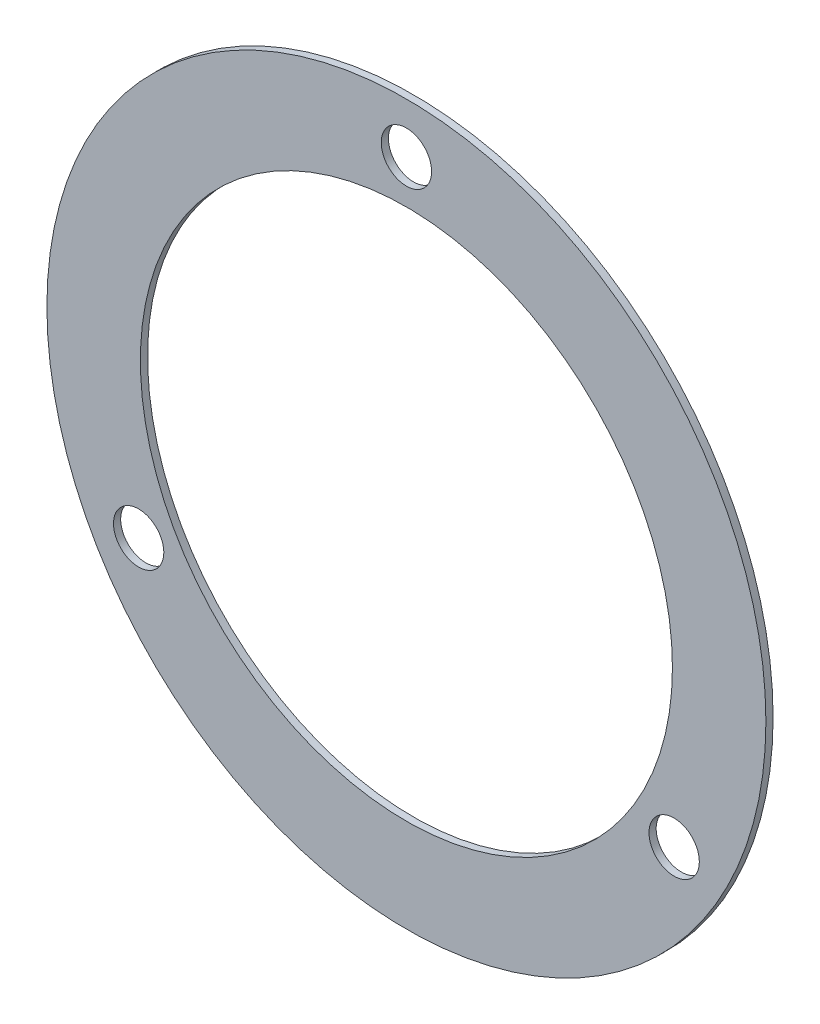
from build123d import *

# Parameters (mm, degrees)
ESQUISSE1_R          = 50
ESQUISSE1_R_2        = 37
ESQUISSE1_R_3        = 3.5
BASE_EXTRUSION_DEPTH = 1


with BuildPart() as part:
    # Esquisse1 → Base-Extrusion (new body)
    with BuildSketch(Plane.XY):
        Circle(ESQUISSE1_R)
        Circle(ESQUISSE1_R_2, mode=Mode.SUBTRACT)
        with Locations((-37.239092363, -21.5)):
            Circle(ESQUISSE1_R_3, mode=Mode.SUBTRACT)
        with Locations((37.239092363, -21.5)):
            Circle(ESQUISSE1_R_3, mode=Mode.SUBTRACT)
        with Locations((0, 43)):
            Circle(ESQUISSE1_R_3, mode=Mode.SUBTRACT)
    extrude(amount=BASE_EXTRUSION_DEPTH)


solid = part.part
